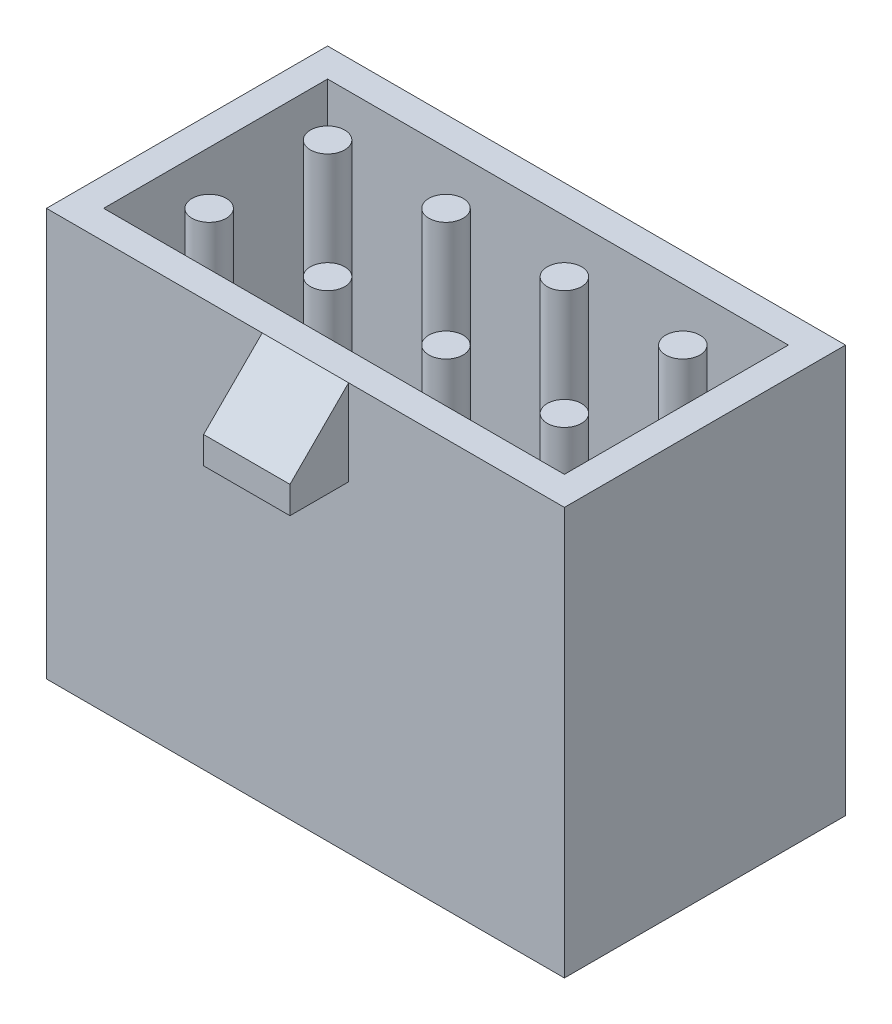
ISO-10303-21;
HEADER;
FILE_DESCRIPTION(('STEP AP214'),'2;1');
FILE_NAME('part.step','',(''),(''),'','','');
FILE_SCHEMA(('AUTOMOTIVE_DESIGN { 1 0 10303 214 1 1 1 1 }'));
ENDSEC;
DATA;
#1=APPLICATION_CONTEXT('core data for automotive mechanical design processes');
#2=APPLICATION_PROTOCOL_DEFINITION('international standard','automotive_design',2000,#1);
#3=PRODUCT_CONTEXT('',#1,'mechanical');
#4=PRODUCT('Part','Part','',(#3));
#5=PRODUCT_RELATED_PRODUCT_CATEGORY('part','',(#4));
#6=PRODUCT_DEFINITION_FORMATION('','',#4);
#7=PRODUCT_DEFINITION_CONTEXT('part definition',#1,'design');
#8=PRODUCT_DEFINITION('design','',#6,#7);
#9=PRODUCT_DEFINITION_SHAPE('','',#8);
#10=(LENGTH_UNIT() NAMED_UNIT(*) SI_UNIT(.MILLI.,.METRE.));
#11=(NAMED_UNIT(*) PLANE_ANGLE_UNIT() SI_UNIT($,.RADIAN.));
#12=(NAMED_UNIT(*) SI_UNIT($,.STERADIAN.) SOLID_ANGLE_UNIT());
#13=UNCERTAINTY_MEASURE_WITH_UNIT(LENGTH_MEASURE(1.E-05),#10,'distance_accuracy_value','');
#14=(GEOMETRIC_REPRESENTATION_CONTEXT(3) GLOBAL_UNCERTAINTY_ASSIGNED_CONTEXT((#13)) GLOBAL_UNIT_ASSIGNED_CONTEXT((#10,
#11,#12)) REPRESENTATION_CONTEXT('',''));
#15=CARTESIAN_POINT('',(0.,0.,0.));
#16=DIRECTION('',(0.,0.,1.));
#17=DIRECTION('',(1.,0.,0.));
#18=AXIS2_PLACEMENT_3D('',#15,#16,#17);
#19=CARTESIAN_POINT('',(0.,14.25,0.));
#20=DIRECTION('',(0.,0.,-1.));
#21=DIRECTION('',(-1.,0.,0.));
#22=AXIS2_PLACEMENT_3D('',#19,#20,#21);
#23=PLANE('',#22);
#24=DIRECTION('',(0.,-1.,0.));
#25=VECTOR('',#24,1.);
#26=CARTESIAN_POINT('',(7.545,14.25,0.));
#27=LINE('',#26,#25);
#28=CARTESIAN_POINT('',(7.545,14.25,0.));
#29=VERTEX_POINT('',#28);
#30=CARTESIAN_POINT('',(7.545,11.25,0.));
#31=VERTEX_POINT('',#30);
#32=EDGE_CURVE('E138',#29,#31,#27,.T.);
#33=ORIENTED_EDGE('',*,*,#32,.F.);
#34=DIRECTION('',(1.,0.,0.));
#35=VECTOR('',#34,1.);
#36=CARTESIAN_POINT('',(0.,14.25,0.));
#37=LINE('',#36,#35);
#38=CARTESIAN_POINT('',(0.,14.25,0.));
#39=VERTEX_POINT('',#38);
#40=EDGE_CURVE('E248',#39,#29,#37,.T.);
#41=ORIENTED_EDGE('',*,*,#40,.F.);
#42=DIRECTION('',(0.,-1.,0.));
#43=VECTOR('',#42,1.);
#44=CARTESIAN_POINT('',(0.,14.25,0.));
#45=LINE('',#44,#43);
#46=CARTESIAN_POINT('',(0.,0.,0.));
#47=VERTEX_POINT('',#46);
#48=EDGE_CURVE('E251',#39,#47,#45,.T.);
#49=ORIENTED_EDGE('',*,*,#48,.T.);
#50=DIRECTION('',(1.,0.,0.));
#51=VECTOR('',#50,1.);
#52=CARTESIAN_POINT('',(0.,0.,0.));
#53=LINE('',#52,#51);
#54=CARTESIAN_POINT('',(18.11,0.,0.));
#55=VERTEX_POINT('',#54);
#56=EDGE_CURVE('E231',#47,#55,#53,.T.);
#57=ORIENTED_EDGE('',*,*,#56,.T.);
#58=DIRECTION('',(0.,-1.,0.));
#59=VECTOR('',#58,1.);
#60=CARTESIAN_POINT('',(18.11,14.25,0.));
#61=LINE('',#60,#59);
#62=CARTESIAN_POINT('',(18.11,14.25,0.));
#63=VERTEX_POINT('',#62);
#64=EDGE_CURVE('E255',#63,#55,#61,.T.);
#65=ORIENTED_EDGE('',*,*,#64,.F.);
#66=CARTESIAN_POINT('',(10.565,14.25,0.));
#67=VERTEX_POINT('',#66);
#68=EDGE_CURVE('E126',#67,#63,#37,.T.);
#69=ORIENTED_EDGE('',*,*,#68,.F.);
#70=DIRECTION('',(0.,1.,0.));
#71=VECTOR('',#70,1.);
#72=CARTESIAN_POINT('',(10.565,14.25,0.));
#73=LINE('',#72,#71);
#74=CARTESIAN_POINT('',(10.565,11.25,0.));
#75=VERTEX_POINT('',#74);
#76=EDGE_CURVE('E120',#75,#67,#73,.T.);
#77=ORIENTED_EDGE('',*,*,#76,.F.);
#78=DIRECTION('',(1.,0.,0.));
#79=VECTOR('',#78,1.);
#80=CARTESIAN_POINT('',(7.545,11.25,0.));
#81=LINE('',#80,#79);
#82=EDGE_CURVE('E123',#31,#75,#81,.T.);
#83=ORIENTED_EDGE('',*,*,#82,.F.);
#84=EDGE_LOOP('',(#33,#41,#49,#57,#65,#69,#77,#83));
#85=FACE_BOUND('',#84,.T.);
#86=ADVANCED_FACE('F30',(#85),#23,.F.);
#87=CARTESIAN_POINT('',(0.,14.25,0.));
#88=DIRECTION('',(1.,0.,0.));
#89=DIRECTION('',(0.,0.,-1.));
#90=AXIS2_PLACEMENT_3D('',#87,#88,#89);
#91=PLANE('',#90);
#92=DIRECTION('',(0.,0.,1.));
#93=VECTOR('',#92,1.);
#94=CARTESIAN_POINT('',(0.,0.,0.));
#95=LINE('',#94,#93);
#96=CARTESIAN_POINT('',(0.,0.,-9.83));
#97=VERTEX_POINT('',#96);
#98=EDGE_CURVE('E222',#97,#47,#95,.T.);
#99=ORIENTED_EDGE('',*,*,#98,.T.);
#100=ORIENTED_EDGE('',*,*,#48,.F.);
#101=DIRECTION('',(0.,0.,1.));
#102=VECTOR('',#101,1.);
#103=CARTESIAN_POINT('',(0.,14.25,0.));
#104=LINE('',#103,#102);
#105=CARTESIAN_POINT('',(0.,14.25,-9.83));
#106=VERTEX_POINT('',#105);
#107=EDGE_CURVE('E237',#106,#39,#104,.T.);
#108=ORIENTED_EDGE('',*,*,#107,.F.);
#109=DIRECTION('',(0.,-1.,0.));
#110=VECTOR('',#109,1.);
#111=CARTESIAN_POINT('',(0.,14.25,-9.83));
#112=LINE('',#111,#110);
#113=EDGE_CURVE('E261',#106,#97,#112,.T.);
#114=ORIENTED_EDGE('',*,*,#113,.T.);
#115=EDGE_LOOP('',(#99,#100,#108,#114));
#116=FACE_BOUND('',#115,.T.);
#117=ADVANCED_FACE('F32',(#116),#91,.F.);
#118=CARTESIAN_POINT('',(18.11,14.25,0.));
#119=DIRECTION('',(-1.,0.,0.));
#120=DIRECTION('',(0.,0.,1.));
#121=AXIS2_PLACEMENT_3D('',#118,#119,#120);
#122=PLANE('',#121);
#123=DIRECTION('',(0.,0.,-1.));
#124=VECTOR('',#123,1.);
#125=CARTESIAN_POINT('',(18.11,0.,0.));
#126=LINE('',#125,#124);
#127=CARTESIAN_POINT('',(18.11,0.,-9.83));
#128=VERTEX_POINT('',#127);
#129=EDGE_CURVE('E233',#55,#128,#126,.T.);
#130=ORIENTED_EDGE('',*,*,#129,.T.);
#131=DIRECTION('',(0.,-1.,0.));
#132=VECTOR('',#131,1.);
#133=CARTESIAN_POINT('',(18.11,14.25,-9.83));
#134=LINE('',#133,#132);
#135=CARTESIAN_POINT('',(18.11,14.25,-9.83));
#136=VERTEX_POINT('',#135);
#137=EDGE_CURVE('E258',#136,#128,#134,.T.);
#138=ORIENTED_EDGE('',*,*,#137,.F.);
#139=DIRECTION('',(0.,0.,-1.));
#140=VECTOR('',#139,1.);
#141=CARTESIAN_POINT('',(18.11,14.25,0.));
#142=LINE('',#141,#140);
#143=EDGE_CURVE('E242',#63,#136,#142,.T.);
#144=ORIENTED_EDGE('',*,*,#143,.F.);
#145=ORIENTED_EDGE('',*,*,#64,.T.);
#146=EDGE_LOOP('',(#130,#138,#144,#145));
#147=FACE_BOUND('',#146,.T.);
#148=ADVANCED_FACE('F271',(#147),#122,.F.);
#149=CARTESIAN_POINT('',(0.,14.25,-9.83));
#150=DIRECTION('',(0.,0.,1.));
#151=DIRECTION('',(1.,0.,0.));
#152=AXIS2_PLACEMENT_3D('',#149,#150,#151);
#153=PLANE('',#152);
#154=DIRECTION('',(-1.,0.,0.));
#155=VECTOR('',#154,1.);
#156=CARTESIAN_POINT('',(0.,0.,-9.83));
#157=LINE('',#156,#155);
#158=EDGE_CURVE('E235',#128,#97,#157,.T.);
#159=ORIENTED_EDGE('',*,*,#158,.T.);
#160=ORIENTED_EDGE('',*,*,#113,.F.);
#161=DIRECTION('',(-1.,0.,0.));
#162=VECTOR('',#161,1.);
#163=CARTESIAN_POINT('',(0.,14.25,-9.83));
#164=LINE('',#163,#162);
#165=EDGE_CURVE('E263',#136,#106,#164,.T.);
#166=ORIENTED_EDGE('',*,*,#165,.F.);
#167=ORIENTED_EDGE('',*,*,#137,.T.);
#168=EDGE_LOOP('',(#159,#160,#166,#167));
#169=FACE_BOUND('',#168,.T.);
#170=ADVANCED_FACE('F275',(#169),#153,.F.);
#171=CARTESIAN_POINT('',(0.,14.25,-9.83));
#172=DIRECTION('',(0.,-1.,0.));
#173=DIRECTION('',(0.,0.,-1.));
#174=AXIS2_PLACEMENT_3D('',#171,#172,#173);
#175=PLANE('',#174);
#176=DIRECTION('',(-1.,0.,0.));
#177=VECTOR('',#176,1.);
#178=CARTESIAN_POINT('',(17.11,14.25,-8.83));
#179=LINE('',#178,#177);
#180=CARTESIAN_POINT('',(17.11,14.25,-8.83));
#181=VERTEX_POINT('',#180);
#182=CARTESIAN_POINT('',(1.,14.25,-8.83));
#183=VERTEX_POINT('',#182);
#184=EDGE_CURVE('E198',#181,#183,#179,.T.);
#185=ORIENTED_EDGE('',*,*,#184,.F.);
#186=DIRECTION('',(0.,0.,-1.));
#187=VECTOR('',#186,1.);
#188=CARTESIAN_POINT('',(17.11,14.25,-1.));
#189=LINE('',#188,#187);
#190=CARTESIAN_POINT('',(17.11,14.25,-1.));
#191=VERTEX_POINT('',#190);
#192=EDGE_CURVE('E196',#191,#181,#189,.T.);
#193=ORIENTED_EDGE('',*,*,#192,.F.);
#194=DIRECTION('',(1.,0.,0.));
#195=VECTOR('',#194,1.);
#196=CARTESIAN_POINT('',(17.11,14.25,-1.));
#197=LINE('',#196,#195);
#198=CARTESIAN_POINT('',(1.,14.25,-1.));
#199=VERTEX_POINT('',#198);
#200=EDGE_CURVE('E204',#199,#191,#197,.T.);
#201=ORIENTED_EDGE('',*,*,#200,.F.);
#202=DIRECTION('',(0.,0.,1.));
#203=VECTOR('',#202,1.);
#204=CARTESIAN_POINT('',(1.,14.25,-1.));
#205=LINE('',#204,#203);
#206=EDGE_CURVE('E201',#183,#199,#205,.T.);
#207=ORIENTED_EDGE('',*,*,#206,.F.);
#208=EDGE_LOOP('',(#185,#193,#201,#207));
#209=FACE_BOUND('',#208,.T.);
#210=ORIENTED_EDGE('',*,*,#40,.T.);
#211=DIRECTION('',(1.,0.,0.));
#212=VECTOR('',#211,1.);
#213=CARTESIAN_POINT('',(10.565,14.25,0.));
#214=LINE('',#213,#212);
#215=EDGE_CURVE('E39',#29,#67,#214,.T.);
#216=ORIENTED_EDGE('',*,*,#215,.T.);
#217=ORIENTED_EDGE('',*,*,#68,.T.);
#218=ORIENTED_EDGE('',*,*,#143,.T.);
#219=ORIENTED_EDGE('',*,*,#165,.T.);
#220=ORIENTED_EDGE('',*,*,#107,.T.);
#221=EDGE_LOOP('',(#210,#216,#217,#218,#219,#220));
#222=FACE_BOUND('',#221,.T.);
#223=ADVANCED_FACE('F269',(#209,#222),#175,.F.);
#224=CARTESIAN_POINT('',(0.,0.,-9.83));
#225=DIRECTION('',(0.,-1.,0.));
#226=DIRECTION('',(0.,0.,-1.));
#227=AXIS2_PLACEMENT_3D('',#224,#225,#226);
#228=PLANE('',#227);
#229=ORIENTED_EDGE('',*,*,#98,.F.);
#230=ORIENTED_EDGE('',*,*,#158,.F.);
#231=ORIENTED_EDGE('',*,*,#129,.F.);
#232=ORIENTED_EDGE('',*,*,#56,.F.);
#233=EDGE_LOOP('',(#229,#230,#231,#232));
#234=FACE_BOUND('',#233,.T.);
#235=ADVANCED_FACE('F321',(#234),#228,.T.);
#236=CARTESIAN_POINT('',(17.11,4.25,-1.));
#237=DIRECTION('',(1.,0.,0.));
#238=DIRECTION('',(0.,0.,-1.));
#239=AXIS2_PLACEMENT_3D('',#236,#237,#238);
#240=PLANE('',#239);
#241=ORIENTED_EDGE('',*,*,#192,.T.);
#242=DIRECTION('',(0.,1.,0.));
#243=VECTOR('',#242,1.);
#244=CARTESIAN_POINT('',(17.11,4.25,-8.83));
#245=LINE('',#244,#243);
#246=CARTESIAN_POINT('',(17.11,4.25,-8.83));
#247=VERTEX_POINT('',#246);
#248=EDGE_CURVE('E219',#247,#181,#245,.T.);
#249=ORIENTED_EDGE('',*,*,#248,.F.);
#250=DIRECTION('',(0.,0.,-1.));
#251=VECTOR('',#250,1.);
#252=CARTESIAN_POINT('',(17.11,4.25,-1.));
#253=LINE('',#252,#251);
#254=CARTESIAN_POINT('',(17.11,4.25,-1.));
#255=VERTEX_POINT('',#254);
#256=EDGE_CURVE('E207',#255,#247,#253,.T.);
#257=ORIENTED_EDGE('',*,*,#256,.F.);
#258=DIRECTION('',(0.,1.,0.));
#259=VECTOR('',#258,1.);
#260=CARTESIAN_POINT('',(17.11,4.25,-1.));
#261=LINE('',#260,#259);
#262=EDGE_CURVE('E220',#255,#191,#261,.T.);
#263=ORIENTED_EDGE('',*,*,#262,.T.);
#264=EDGE_LOOP('',(#241,#249,#257,#263));
#265=FACE_BOUND('',#264,.T.);
#266=ADVANCED_FACE('F325',(#265),#240,.F.);
#267=CARTESIAN_POINT('',(17.11,4.25,-1.));
#268=DIRECTION('',(0.,0.,1.));
#269=DIRECTION('',(1.,0.,0.));
#270=AXIS2_PLACEMENT_3D('',#267,#268,#269);
#271=PLANE('',#270);
#272=ORIENTED_EDGE('',*,*,#200,.T.);
#273=ORIENTED_EDGE('',*,*,#262,.F.);
#274=DIRECTION('',(1.,0.,0.));
#275=VECTOR('',#274,1.);
#276=CARTESIAN_POINT('',(17.11,4.25,-1.));
#277=LINE('',#276,#275);
#278=CARTESIAN_POINT('',(1.,4.25,-1.));
#279=VERTEX_POINT('',#278);
#280=EDGE_CURVE('E216',#279,#255,#277,.T.);
#281=ORIENTED_EDGE('',*,*,#280,.F.);
#282=DIRECTION('',(0.,1.,0.));
#283=VECTOR('',#282,1.);
#284=CARTESIAN_POINT('',(1.,4.25,-1.));
#285=LINE('',#284,#283);
#286=EDGE_CURVE('E223',#279,#199,#285,.T.);
#287=ORIENTED_EDGE('',*,*,#286,.T.);
#288=EDGE_LOOP('',(#272,#273,#281,#287));
#289=FACE_BOUND('',#288,.T.);
#290=ADVANCED_FACE('F329',(#289),#271,.F.);
#291=CARTESIAN_POINT('',(1.,4.25,-1.));
#292=DIRECTION('',(-1.,0.,0.));
#293=DIRECTION('',(0.,0.,1.));
#294=AXIS2_PLACEMENT_3D('',#291,#292,#293);
#295=PLANE('',#294);
#296=ORIENTED_EDGE('',*,*,#206,.T.);
#297=ORIENTED_EDGE('',*,*,#286,.F.);
#298=DIRECTION('',(0.,0.,1.));
#299=VECTOR('',#298,1.);
#300=CARTESIAN_POINT('',(1.,4.25,-1.));
#301=LINE('',#300,#299);
#302=CARTESIAN_POINT('',(1.,4.25,-8.83));
#303=VERTEX_POINT('',#302);
#304=EDGE_CURVE('E213',#303,#279,#301,.T.);
#305=ORIENTED_EDGE('',*,*,#304,.F.);
#306=DIRECTION('',(0.,1.,0.));
#307=VECTOR('',#306,1.);
#308=CARTESIAN_POINT('',(1.,4.25,-8.83));
#309=LINE('',#308,#307);
#310=EDGE_CURVE('E225',#303,#183,#309,.T.);
#311=ORIENTED_EDGE('',*,*,#310,.T.);
#312=EDGE_LOOP('',(#296,#297,#305,#311));
#313=FACE_BOUND('',#312,.T.);
#314=ADVANCED_FACE('F335',(#313),#295,.F.);
#315=CARTESIAN_POINT('',(17.11,4.25,-8.83));
#316=DIRECTION('',(0.,0.,-1.));
#317=DIRECTION('',(-1.,0.,0.));
#318=AXIS2_PLACEMENT_3D('',#315,#316,#317);
#319=PLANE('',#318);
#320=ORIENTED_EDGE('',*,*,#184,.T.);
#321=ORIENTED_EDGE('',*,*,#310,.F.);
#322=DIRECTION('',(-1.,0.,0.));
#323=VECTOR('',#322,1.);
#324=CARTESIAN_POINT('',(17.11,4.25,-8.83));
#325=LINE('',#324,#323);
#326=EDGE_CURVE('E210',#247,#303,#325,.T.);
#327=ORIENTED_EDGE('',*,*,#326,.F.);
#328=ORIENTED_EDGE('',*,*,#248,.T.);
#329=EDGE_LOOP('',(#320,#321,#327,#328));
#330=FACE_BOUND('',#329,.T.);
#331=ADVANCED_FACE('F331',(#330),#319,.F.);
#332=CARTESIAN_POINT('',(17.11,4.25,-8.83));
#333=DIRECTION('',(0.,1.,0.));
#334=DIRECTION('',(0.,0.,1.));
#335=AXIS2_PLACEMENT_3D('',#332,#333,#334);
#336=PLANE('',#335);
#337=CARTESIAN_POINT('',(2.845,4.25,-2.845));
#338=DIRECTION('',(0.,1.,0.));
#339=DIRECTION('',(0.,0.,-1.));
#340=AXIS2_PLACEMENT_3D('',#337,#338,#339);
#341=CIRCLE('',#340,0.6);
#342=CARTESIAN_POINT('',(2.845,4.25,-3.445));
#343=VERTEX_POINT('',#342);
#344=EDGE_CURVE('E151',#343,#343,#341,.T.);
#345=ORIENTED_EDGE('',*,*,#344,.F.);
#346=EDGE_LOOP('',(#345));
#347=FACE_BOUND('',#346,.T.);
#348=CARTESIAN_POINT('',(6.985,4.25,-2.845));
#349=DIRECTION('',(0.,1.,0.));
#350=DIRECTION('',(0.,0.,-1.));
#351=AXIS2_PLACEMENT_3D('',#348,#349,#350);
#352=CIRCLE('',#351,0.6);
#353=CARTESIAN_POINT('',(6.985,4.25,-3.445));
#354=VERTEX_POINT('',#353);
#355=EDGE_CURVE('E157',#354,#354,#352,.T.);
#356=ORIENTED_EDGE('',*,*,#355,.F.);
#357=EDGE_LOOP('',(#356));
#358=FACE_BOUND('',#357,.T.);
#359=CARTESIAN_POINT('',(6.985,4.25,-6.985));
#360=DIRECTION('',(0.,1.,0.));
#361=DIRECTION('',(0.,0.,1.));
#362=AXIS2_PLACEMENT_3D('',#359,#360,#361);
#363=CIRCLE('',#362,0.6);
#364=CARTESIAN_POINT('',(6.985,4.25,-6.385));
#365=VERTEX_POINT('',#364);
#366=EDGE_CURVE('E163',#365,#365,#363,.T.);
#367=ORIENTED_EDGE('',*,*,#366,.F.);
#368=EDGE_LOOP('',(#367));
#369=FACE_BOUND('',#368,.T.);
#370=CARTESIAN_POINT('',(2.845,4.25,-6.985));
#371=DIRECTION('',(0.,1.,0.));
#372=DIRECTION('',(0.,0.,1.));
#373=AXIS2_PLACEMENT_3D('',#370,#371,#372);
#374=CIRCLE('',#373,0.599999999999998);
#375=CARTESIAN_POINT('',(2.845,4.25,-6.385));
#376=VERTEX_POINT('',#375);
#377=EDGE_CURVE('E169',#376,#376,#374,.T.);
#378=ORIENTED_EDGE('',*,*,#377,.F.);
#379=EDGE_LOOP('',(#378));
#380=FACE_BOUND('',#379,.T.);
#381=CARTESIAN_POINT('',(15.265,4.25,-6.985));
#382=DIRECTION('',(0.,1.,0.));
#383=DIRECTION('',(0.,0.,-1.));
#384=AXIS2_PLACEMENT_3D('',#381,#382,#383);
#385=CIRCLE('',#384,0.6);
#386=CARTESIAN_POINT('',(15.265,4.25,-7.585));
#387=VERTEX_POINT('',#386);
#388=EDGE_CURVE('E175',#387,#387,#385,.T.);
#389=ORIENTED_EDGE('',*,*,#388,.F.);
#390=EDGE_LOOP('',(#389));
#391=FACE_BOUND('',#390,.T.);
#392=CARTESIAN_POINT('',(11.125,4.25,-6.985));
#393=DIRECTION('',(0.,1.,0.));
#394=DIRECTION('',(0.,0.,-1.));
#395=AXIS2_PLACEMENT_3D('',#392,#393,#394);
#396=CIRCLE('',#395,0.6);
#397=CARTESIAN_POINT('',(11.125,4.25,-7.585));
#398=VERTEX_POINT('',#397);
#399=EDGE_CURVE('E181',#398,#398,#396,.T.);
#400=ORIENTED_EDGE('',*,*,#399,.F.);
#401=EDGE_LOOP('',(#400));
#402=FACE_BOUND('',#401,.T.);
#403=CARTESIAN_POINT('',(11.125,4.25,-2.845));
#404=DIRECTION('',(0.,1.,0.));
#405=DIRECTION('',(0.,0.,1.));
#406=AXIS2_PLACEMENT_3D('',#403,#404,#405);
#407=CIRCLE('',#406,0.6);
#408=CARTESIAN_POINT('',(11.125,4.25,-2.245));
#409=VERTEX_POINT('',#408);
#410=EDGE_CURVE('E187',#409,#409,#407,.T.);
#411=ORIENTED_EDGE('',*,*,#410,.F.);
#412=EDGE_LOOP('',(#411));
#413=FACE_BOUND('',#412,.T.);
#414=CARTESIAN_POINT('',(15.265,4.25,-2.845));
#415=DIRECTION('',(0.,1.,0.));
#416=DIRECTION('',(0.,0.,1.));
#417=AXIS2_PLACEMENT_3D('',#414,#415,#416);
#418=CIRCLE('',#417,0.6);
#419=CARTESIAN_POINT('',(15.265,4.25,-2.245));
#420=VERTEX_POINT('',#419);
#421=EDGE_CURVE('E193',#420,#420,#418,.T.);
#422=ORIENTED_EDGE('',*,*,#421,.F.);
#423=EDGE_LOOP('',(#422));
#424=FACE_BOUND('',#423,.T.);
#425=ORIENTED_EDGE('',*,*,#256,.T.);
#426=ORIENTED_EDGE('',*,*,#326,.T.);
#427=ORIENTED_EDGE('',*,*,#304,.T.);
#428=ORIENTED_EDGE('',*,*,#280,.T.);
#429=EDGE_LOOP('',(#425,#426,#427,#428));
#430=FACE_BOUND('',#429,.T.);
#431=ADVANCED_FACE('F334',(#347,#358,#369,#380,#391,#402,#413,#424,#430),#336,.T.);
#432=CARTESIAN_POINT('',(15.265,4.25,-2.845));
#433=DIRECTION('',(0.,1.,0.));
#434=DIRECTION('',(0.,0.,1.));
#435=AXIS2_PLACEMENT_3D('',#432,#433,#434);
#436=CYLINDRICAL_SURFACE('',#435,0.6);
#437=ORIENTED_EDGE('',*,*,#421,.T.);
#438=EDGE_LOOP('',(#437));
#439=FACE_BOUND('',#438,.T.);
#440=CARTESIAN_POINT('',(15.265,14.25,-2.845));
#441=DIRECTION('',(0.,1.,0.));
#442=DIRECTION('',(0.,0.,1.));
#443=AXIS2_PLACEMENT_3D('',#440,#441,#442);
#444=CIRCLE('',#443,0.6);
#445=CARTESIAN_POINT('',(15.265,14.25,-2.245));
#446=VERTEX_POINT('',#445);
#447=EDGE_CURVE('E190',#446,#446,#444,.T.);
#448=ORIENTED_EDGE('',*,*,#447,.F.);
#449=EDGE_LOOP('',(#448));
#450=FACE_BOUND('',#449,.T.);
#451=ADVANCED_FACE('F345',(#439,#450),#436,.T.);
#452=CARTESIAN_POINT('',(11.125,4.25,-2.845));
#453=DIRECTION('',(0.,1.,0.));
#454=DIRECTION('',(0.,0.,1.));
#455=AXIS2_PLACEMENT_3D('',#452,#453,#454);
#456=CYLINDRICAL_SURFACE('',#455,0.6);
#457=ORIENTED_EDGE('',*,*,#410,.T.);
#458=EDGE_LOOP('',(#457));
#459=FACE_BOUND('',#458,.T.);
#460=CARTESIAN_POINT('',(11.125,14.25,-2.845));
#461=DIRECTION('',(0.,1.,0.));
#462=DIRECTION('',(0.,0.,1.));
#463=AXIS2_PLACEMENT_3D('',#460,#461,#462);
#464=CIRCLE('',#463,0.6);
#465=CARTESIAN_POINT('',(11.125,14.25,-2.245));
#466=VERTEX_POINT('',#465);
#467=EDGE_CURVE('E184',#466,#466,#464,.T.);
#468=ORIENTED_EDGE('',*,*,#467,.F.);
#469=EDGE_LOOP('',(#468));
#470=FACE_BOUND('',#469,.T.);
#471=ADVANCED_FACE('F349',(#459,#470),#456,.T.);
#472=CARTESIAN_POINT('',(11.125,4.25,-6.985));
#473=DIRECTION('',(0.,1.,0.));
#474=DIRECTION('',(0.,0.,1.));
#475=AXIS2_PLACEMENT_3D('',#472,#473,#474);
#476=CYLINDRICAL_SURFACE('',#475,0.6);
#477=ORIENTED_EDGE('',*,*,#399,.T.);
#478=EDGE_LOOP('',(#477));
#479=FACE_BOUND('',#478,.T.);
#480=CARTESIAN_POINT('',(11.125,14.25,-6.985));
#481=DIRECTION('',(0.,1.,0.));
#482=DIRECTION('',(0.,0.,-1.));
#483=AXIS2_PLACEMENT_3D('',#480,#481,#482);
#484=CIRCLE('',#483,0.6);
#485=CARTESIAN_POINT('',(11.125,14.25,-7.585));
#486=VERTEX_POINT('',#485);
#487=EDGE_CURVE('E178',#486,#486,#484,.T.);
#488=ORIENTED_EDGE('',*,*,#487,.F.);
#489=EDGE_LOOP('',(#488));
#490=FACE_BOUND('',#489,.T.);
#491=ADVANCED_FACE('F353',(#479,#490),#476,.T.);
#492=CARTESIAN_POINT('',(15.265,4.25,-6.985));
#493=DIRECTION('',(0.,1.,0.));
#494=DIRECTION('',(0.,0.,1.));
#495=AXIS2_PLACEMENT_3D('',#492,#493,#494);
#496=CYLINDRICAL_SURFACE('',#495,0.6);
#497=ORIENTED_EDGE('',*,*,#388,.T.);
#498=EDGE_LOOP('',(#497));
#499=FACE_BOUND('',#498,.T.);
#500=CARTESIAN_POINT('',(15.265,14.25,-6.985));
#501=DIRECTION('',(0.,1.,0.));
#502=DIRECTION('',(0.,0.,-1.));
#503=AXIS2_PLACEMENT_3D('',#500,#501,#502);
#504=CIRCLE('',#503,0.6);
#505=CARTESIAN_POINT('',(15.265,14.25,-7.585));
#506=VERTEX_POINT('',#505);
#507=EDGE_CURVE('E172',#506,#506,#504,.T.);
#508=ORIENTED_EDGE('',*,*,#507,.F.);
#509=EDGE_LOOP('',(#508));
#510=FACE_BOUND('',#509,.T.);
#511=ADVANCED_FACE('F357',(#499,#510),#496,.T.);
#512=CARTESIAN_POINT('',(2.845,4.25,-6.985));
#513=DIRECTION('',(0.,1.,0.));
#514=DIRECTION('',(0.,0.,1.));
#515=AXIS2_PLACEMENT_3D('',#512,#513,#514);
#516=CYLINDRICAL_SURFACE('',#515,0.599999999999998);
#517=ORIENTED_EDGE('',*,*,#377,.T.);
#518=EDGE_LOOP('',(#517));
#519=FACE_BOUND('',#518,.T.);
#520=CARTESIAN_POINT('',(2.845,14.25,-6.985));
#521=DIRECTION('',(0.,1.,0.));
#522=DIRECTION('',(0.,0.,1.));
#523=AXIS2_PLACEMENT_3D('',#520,#521,#522);
#524=CIRCLE('',#523,0.599999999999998);
#525=CARTESIAN_POINT('',(2.845,14.25,-6.385));
#526=VERTEX_POINT('',#525);
#527=EDGE_CURVE('E166',#526,#526,#524,.T.);
#528=ORIENTED_EDGE('',*,*,#527,.F.);
#529=EDGE_LOOP('',(#528));
#530=FACE_BOUND('',#529,.T.);
#531=ADVANCED_FACE('F361',(#519,#530),#516,.T.);
#532=CARTESIAN_POINT('',(6.985,4.25,-6.985));
#533=DIRECTION('',(0.,1.,0.));
#534=DIRECTION('',(0.,0.,1.));
#535=AXIS2_PLACEMENT_3D('',#532,#533,#534);
#536=CYLINDRICAL_SURFACE('',#535,0.6);
#537=ORIENTED_EDGE('',*,*,#366,.T.);
#538=EDGE_LOOP('',(#537));
#539=FACE_BOUND('',#538,.T.);
#540=CARTESIAN_POINT('',(6.985,14.25,-6.985));
#541=DIRECTION('',(0.,1.,0.));
#542=DIRECTION('',(0.,0.,1.));
#543=AXIS2_PLACEMENT_3D('',#540,#541,#542);
#544=CIRCLE('',#543,0.6);
#545=CARTESIAN_POINT('',(6.985,14.25,-6.385));
#546=VERTEX_POINT('',#545);
#547=EDGE_CURVE('E160',#546,#546,#544,.T.);
#548=ORIENTED_EDGE('',*,*,#547,.F.);
#549=EDGE_LOOP('',(#548));
#550=FACE_BOUND('',#549,.T.);
#551=ADVANCED_FACE('F365',(#539,#550),#536,.T.);
#552=CARTESIAN_POINT('',(6.985,4.25,-2.845));
#553=DIRECTION('',(0.,1.,0.));
#554=DIRECTION('',(0.,0.,1.));
#555=AXIS2_PLACEMENT_3D('',#552,#553,#554);
#556=CYLINDRICAL_SURFACE('',#555,0.6);
#557=ORIENTED_EDGE('',*,*,#355,.T.);
#558=EDGE_LOOP('',(#557));
#559=FACE_BOUND('',#558,.T.);
#560=CARTESIAN_POINT('',(6.985,14.25,-2.845));
#561=DIRECTION('',(0.,1.,0.));
#562=DIRECTION('',(0.,0.,-1.));
#563=AXIS2_PLACEMENT_3D('',#560,#561,#562);
#564=CIRCLE('',#563,0.6);
#565=CARTESIAN_POINT('',(6.985,14.25,-3.445));
#566=VERTEX_POINT('',#565);
#567=EDGE_CURVE('E154',#566,#566,#564,.T.);
#568=ORIENTED_EDGE('',*,*,#567,.F.);
#569=EDGE_LOOP('',(#568));
#570=FACE_BOUND('',#569,.T.);
#571=ADVANCED_FACE('F369',(#559,#570),#556,.T.);
#572=CARTESIAN_POINT('',(2.845,4.25,-2.845));
#573=DIRECTION('',(0.,1.,0.));
#574=DIRECTION('',(0.,0.,1.));
#575=AXIS2_PLACEMENT_3D('',#572,#573,#574);
#576=CYLINDRICAL_SURFACE('',#575,0.6);
#577=ORIENTED_EDGE('',*,*,#344,.T.);
#578=EDGE_LOOP('',(#577));
#579=FACE_BOUND('',#578,.T.);
#580=CARTESIAN_POINT('',(2.845,14.25,-2.845));
#581=DIRECTION('',(0.,1.,0.));
#582=DIRECTION('',(0.,0.,-1.));
#583=AXIS2_PLACEMENT_3D('',#580,#581,#582);
#584=CIRCLE('',#583,0.6);
#585=CARTESIAN_POINT('',(2.845,14.25,-3.445));
#586=VERTEX_POINT('',#585);
#587=EDGE_CURVE('E143',#586,#586,#584,.T.);
#588=ORIENTED_EDGE('',*,*,#587,.F.);
#589=EDGE_LOOP('',(#588));
#590=FACE_BOUND('',#589,.T.);
#591=ADVANCED_FACE('F372',(#579,#590),#576,.T.);
#592=ORIENTED_EDGE('',*,*,#567,.T.);
#593=EDGE_LOOP('',(#592));
#594=FACE_BOUND('',#593,.T.);
#595=ADVANCED_FACE('F309',(#594),#175,.F.);
#596=ORIENTED_EDGE('',*,*,#547,.T.);
#597=EDGE_LOOP('',(#596));
#598=FACE_BOUND('',#597,.T.);
#599=ADVANCED_FACE('F379',(#598),#175,.F.);
#600=ORIENTED_EDGE('',*,*,#527,.T.);
#601=EDGE_LOOP('',(#600));
#602=FACE_BOUND('',#601,.T.);
#603=ADVANCED_FACE('F427',(#602),#175,.F.);
#604=ORIENTED_EDGE('',*,*,#507,.T.);
#605=EDGE_LOOP('',(#604));
#606=FACE_BOUND('',#605,.T.);
#607=ADVANCED_FACE('F420',(#606),#175,.F.);
#608=ORIENTED_EDGE('',*,*,#487,.T.);
#609=EDGE_LOOP('',(#608));
#610=FACE_BOUND('',#609,.T.);
#611=ADVANCED_FACE('F415',(#610),#175,.F.);
#612=ORIENTED_EDGE('',*,*,#467,.T.);
#613=EDGE_LOOP('',(#612));
#614=FACE_BOUND('',#613,.T.);
#615=ADVANCED_FACE('F411',(#614),#175,.F.);
#616=ORIENTED_EDGE('',*,*,#447,.T.);
#617=EDGE_LOOP('',(#616));
#618=FACE_BOUND('',#617,.T.);
#619=ADVANCED_FACE('F306',(#618),#175,.F.);
#620=ORIENTED_EDGE('',*,*,#587,.T.);
#621=EDGE_LOOP('',(#620));
#622=FACE_BOUND('',#621,.T.);
#623=ADVANCED_FACE('F299',(#622),#175,.F.);
#624=CARTESIAN_POINT('',(7.545,14.25,2.05));
#625=DIRECTION('',(1.,0.,0.));
#626=DIRECTION('',(0.,0.,-1.));
#627=AXIS2_PLACEMENT_3D('',#624,#625,#626);
#628=PLANE('',#627);
#629=DIRECTION('',(0.,-1.,0.));
#630=VECTOR('',#629,1.);
#631=CARTESIAN_POINT('',(7.545,14.25,2.05));
#632=LINE('',#631,#630);
#633=CARTESIAN_POINT('',(7.545,12.2,2.05));
#634=VERTEX_POINT('',#633);
#635=CARTESIAN_POINT('',(7.545,11.25,2.05));
#636=VERTEX_POINT('',#635);
#637=EDGE_CURVE('E128',#634,#636,#632,.T.);
#638=ORIENTED_EDGE('',*,*,#637,.F.);
#639=DIRECTION('',(0.,0.707106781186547,-0.707106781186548));
#640=VECTOR('',#639,1.);
#641=CARTESIAN_POINT('',(7.545,12.2,2.05));
#642=LINE('',#641,#640);
#643=EDGE_CURVE('E52',#634,#29,#642,.T.);
#644=ORIENTED_EDGE('',*,*,#643,.T.);
#645=ORIENTED_EDGE('',*,*,#32,.T.);
#646=DIRECTION('',(0.,0.,-1.));
#647=VECTOR('',#646,1.);
#648=CARTESIAN_POINT('',(7.545,11.25,2.05));
#649=LINE('',#648,#647);
#650=EDGE_CURVE('E136',#636,#31,#649,.T.);
#651=ORIENTED_EDGE('',*,*,#650,.F.);
#652=EDGE_LOOP('',(#638,#644,#645,#651));
#653=FACE_BOUND('',#652,.T.);
#654=ADVANCED_FACE('F297',(#653),#628,.F.);
#655=CARTESIAN_POINT('',(7.545,11.25,2.05));
#656=DIRECTION('',(0.,1.,0.));
#657=DIRECTION('',(-1.,0.,0.));
#658=AXIS2_PLACEMENT_3D('',#655,#656,#657);
#659=PLANE('',#658);
#660=ORIENTED_EDGE('',*,*,#82,.T.);
#661=DIRECTION('',(0.,0.,-1.));
#662=VECTOR('',#661,1.);
#663=CARTESIAN_POINT('',(10.565,11.25,2.05));
#664=LINE('',#663,#662);
#665=CARTESIAN_POINT('',(10.565,11.25,2.05));
#666=VERTEX_POINT('',#665);
#667=EDGE_CURVE('E134',#666,#75,#664,.T.);
#668=ORIENTED_EDGE('',*,*,#667,.F.);
#669=DIRECTION('',(1.,0.,0.));
#670=VECTOR('',#669,1.);
#671=CARTESIAN_POINT('',(7.545,11.25,2.05));
#672=LINE('',#671,#670);
#673=EDGE_CURVE('E145',#636,#666,#672,.T.);
#674=ORIENTED_EDGE('',*,*,#673,.F.);
#675=ORIENTED_EDGE('',*,*,#650,.T.);
#676=EDGE_LOOP('',(#660,#668,#674,#675));
#677=FACE_BOUND('',#676,.T.);
#678=ADVANCED_FACE('F132',(#677),#659,.F.);
#679=CARTESIAN_POINT('',(10.565,14.25,2.05));
#680=DIRECTION('',(-1.,0.,0.));
#681=DIRECTION('',(0.,0.,1.));
#682=AXIS2_PLACEMENT_3D('',#679,#680,#681);
#683=PLANE('',#682);
#684=ORIENTED_EDGE('',*,*,#76,.T.);
#685=DIRECTION('',(0.,-0.707106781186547,0.707106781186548));
#686=VECTOR('',#685,1.);
#687=CARTESIAN_POINT('',(10.565,12.2,2.05));
#688=LINE('',#687,#686);
#689=CARTESIAN_POINT('',(10.565,12.2,2.05));
#690=VERTEX_POINT('',#689);
#691=EDGE_CURVE('E11',#67,#690,#688,.T.);
#692=ORIENTED_EDGE('',*,*,#691,.T.);
#693=DIRECTION('',(0.,1.,0.));
#694=VECTOR('',#693,1.);
#695=CARTESIAN_POINT('',(10.565,14.25,2.05));
#696=LINE('',#695,#694);
#697=EDGE_CURVE('E141',#666,#690,#696,.T.);
#698=ORIENTED_EDGE('',*,*,#697,.F.);
#699=ORIENTED_EDGE('',*,*,#667,.T.);
#700=EDGE_LOOP('',(#684,#692,#698,#699));
#701=FACE_BOUND('',#700,.T.);
#702=ADVANCED_FACE('F140',(#701),#683,.F.);
#703=CARTESIAN_POINT('',(7.545,14.25,2.05));
#704=DIRECTION('',(0.,0.,1.));
#705=DIRECTION('',(1.,0.,0.));
#706=AXIS2_PLACEMENT_3D('',#703,#704,#705);
#707=PLANE('',#706);
#708=ORIENTED_EDGE('',*,*,#697,.T.);
#709=DIRECTION('',(-1.,0.,0.));
#710=VECTOR('',#709,1.);
#711=CARTESIAN_POINT('',(7.545,12.2,2.05));
#712=LINE('',#711,#710);
#713=EDGE_CURVE('E254',#690,#634,#712,.T.);
#714=ORIENTED_EDGE('',*,*,#713,.T.);
#715=ORIENTED_EDGE('',*,*,#637,.T.);
#716=ORIENTED_EDGE('',*,*,#673,.T.);
#717=EDGE_LOOP('',(#708,#714,#715,#716));
#718=FACE_BOUND('',#717,.T.);
#719=ADVANCED_FACE('F294',(#718),#707,.T.);
#720=CARTESIAN_POINT('',(7.545,12.2,2.05));
#721=DIRECTION('',(0.,0.707106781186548,0.707106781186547));
#722=DIRECTION('',(0.,-0.707106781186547,0.707106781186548));
#723=AXIS2_PLACEMENT_3D('',#720,#721,#722);
#724=PLANE('',#723);
#725=ORIENTED_EDGE('',*,*,#691,.F.);
#726=ORIENTED_EDGE('',*,*,#215,.F.);
#727=ORIENTED_EDGE('',*,*,#643,.F.);
#728=ORIENTED_EDGE('',*,*,#713,.F.);
#729=EDGE_LOOP('',(#725,#726,#727,#728));
#730=FACE_BOUND('',#729,.T.);
#731=ADVANCED_FACE('F280',(#730),#724,.T.);
#732=CLOSED_SHELL('',(#86,#117,#148,#170,#223,#235,#266,#290,#314,#331,#431,#451,#471,#491,#511,
#531,#551,#571,#591,#595,#599,#603,#607,#611,#615,#619,#623,#654,#678,#702,#719,#731));
#733=MANIFOLD_SOLID_BREP('B2',#732);
#734=ADVANCED_BREP_SHAPE_REPRESENTATION('',(#18,#733),#14);
#735=SHAPE_DEFINITION_REPRESENTATION(#9,#734);
ENDSEC;
END-ISO-10303-21;
